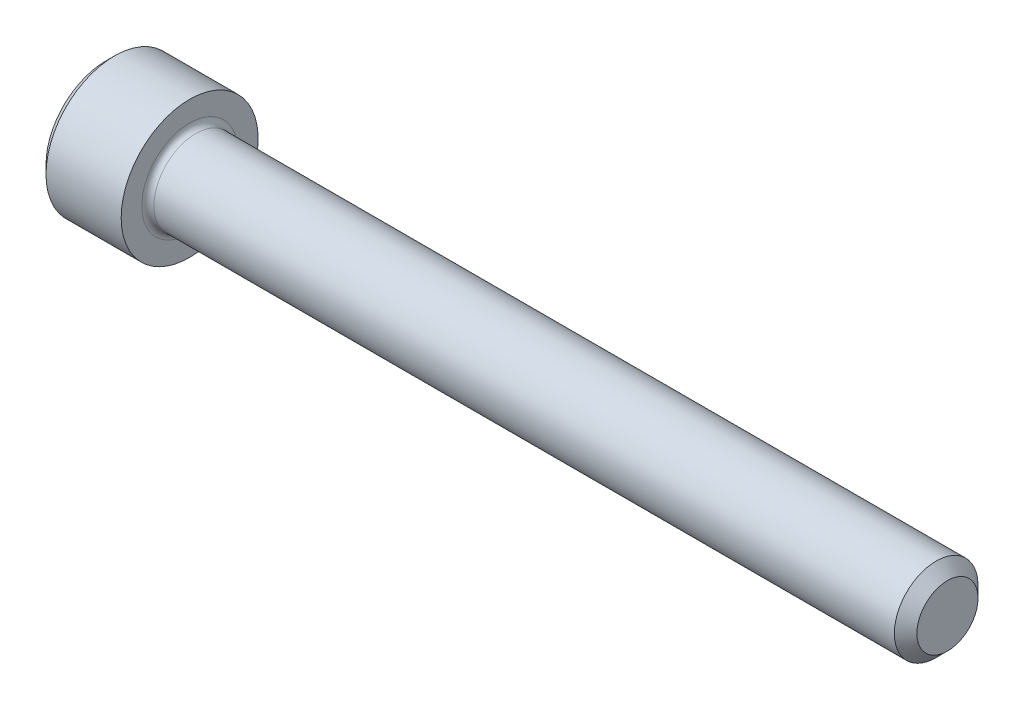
from build123d import *

# Parameters (mm, degrees)
FILLET1_R   = 0.254
HEX_2_DEPTH = 1.6256


with BuildPart() as part:
    # BodySke → Base-Revolve (revolve)
    with BuildSketch(Plane.XY, mode=Mode.PRIVATE) as base_revolve_sk:
        Polygon((0, 0), (0, 2.5146), (0.3556, 2.8702), (3.5052, 2.8702), (3.5052, 1.7526), (34.78276, 1.7526), (35.2552, 1.28016), (35.2552, 0), align=None)
    revolve(base_revolve_sk.sketch.rotate(Axis((-31.75, 0, 0), (1, 0, 0)), 90), axis=Axis((-31.75, 0, 0), (1, 0, 0)))

    # Fillet1
    fillet1_edges = [part.edges().sort_by_distance(p)[0] for p in [
        (3.5052, 0, -1.7526),
    ]]
    fillet(fillet1_edges, radius=FILLET1_R)

    # Sketch2 → Hex-PreBroach (revolve, cut)
    with BuildSketch(Plane.XY, mode=Mode.PRIVATE) as hex_prebroach_sk:
        Polygon((0, 1.3843), (1.6256, 1.3843), (2.424825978, 0), (0, 0), align=None)
    revolve(hex_prebroach_sk.sketch.rotate(Axis((0, 0, 0), (1, 0, 0)), 90), axis=Axis((0, 0, 0), (1, 0, 0)), mode=Mode.SUBTRACT)

    # Sketch3 → Hex 2 (cut)
    with BuildSketch(Plane(origin=(0, 0, 0), x_dir=(0, 0.500000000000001, 0.866025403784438), z_dir=(-1, 0, 0))):
        Polygon((0.799225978, 1.3843), (-0.799225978, 1.3843), (-1.598451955, 0), (-0.799225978, -1.3843), (0.799225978, -1.3843), (1.598451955, 0), align=None)
    extrude(amount=-HEX_2_DEPTH, mode=Mode.SUBTRACT)


solid = part.part
